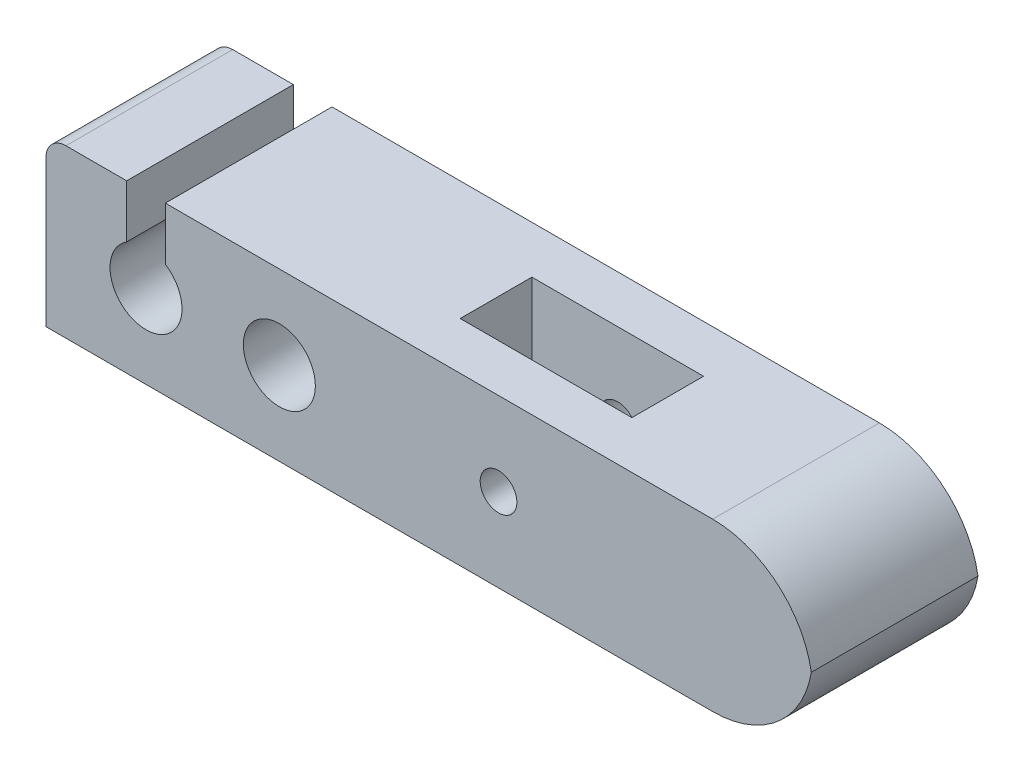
ISO-10303-21;
HEADER;
FILE_DESCRIPTION(('STEP AP214'),'2;1');
FILE_NAME('part.step','',(''),(''),'','','');
FILE_SCHEMA(('AUTOMOTIVE_DESIGN { 1 0 10303 214 1 1 1 1 }'));
ENDSEC;
DATA;
#1=APPLICATION_CONTEXT('core data for automotive mechanical design processes');
#2=APPLICATION_PROTOCOL_DEFINITION('international standard','automotive_design',2000,#1);
#3=PRODUCT_CONTEXT('',#1,'mechanical');
#4=PRODUCT('Part','Part','',(#3));
#5=PRODUCT_RELATED_PRODUCT_CATEGORY('part','',(#4));
#6=PRODUCT_DEFINITION_FORMATION('','',#4);
#7=PRODUCT_DEFINITION_CONTEXT('part definition',#1,'design');
#8=PRODUCT_DEFINITION('design','',#6,#7);
#9=PRODUCT_DEFINITION_SHAPE('','',#8);
#10=(LENGTH_UNIT() NAMED_UNIT(*) SI_UNIT(.MILLI.,.METRE.));
#11=(NAMED_UNIT(*) PLANE_ANGLE_UNIT() SI_UNIT($,.RADIAN.));
#12=(NAMED_UNIT(*) SI_UNIT($,.STERADIAN.) SOLID_ANGLE_UNIT());
#13=UNCERTAINTY_MEASURE_WITH_UNIT(LENGTH_MEASURE(1.E-05),#10,'distance_accuracy_value','');
#14=(GEOMETRIC_REPRESENTATION_CONTEXT(3) GLOBAL_UNCERTAINTY_ASSIGNED_CONTEXT((#13)) GLOBAL_UNIT_ASSIGNED_CONTEXT((#10,
#11,#12)) REPRESENTATION_CONTEXT('',''));
#15=CARTESIAN_POINT('',(0.,0.,0.));
#16=DIRECTION('',(0.,0.,1.));
#17=DIRECTION('',(1.,0.,0.));
#18=AXIS2_PLACEMENT_3D('',#15,#16,#17);
#19=CARTESIAN_POINT('',(-100.,12.5047832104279,25.));
#20=DIRECTION('',(0.,0.,-1.));
#21=DIRECTION('',(-1.,0.,0.));
#22=AXIS2_PLACEMENT_3D('',#19,#20,#21);
#23=CYLINDRICAL_SURFACE('',#22,5.39999999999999);
#24=CARTESIAN_POINT('',(-100.,12.5047832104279,0.));
#25=DIRECTION('',(0.,0.,1.));
#26=DIRECTION('',(1.,0.,0.));
#27=AXIS2_PLACEMENT_3D('',#24,#25,#26);
#28=CIRCLE('',#27,5.39999999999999);
#29=CARTESIAN_POINT('',(-102.9,17.06,0.));
#30=VERTEX_POINT('',#29);
#31=CARTESIAN_POINT('',(-97.1000000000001,17.06,0.));
#32=VERTEX_POINT('',#31);
#33=EDGE_CURVE('E241',#30,#32,#28,.T.);
#34=ORIENTED_EDGE('',*,*,#33,.F.);
#35=DIRECTION('',(0.,0.,-1.));
#36=VECTOR('',#35,1.);
#37=CARTESIAN_POINT('',(-102.9,17.06,25.));
#38=LINE('',#37,#36);
#39=CARTESIAN_POINT('',(-102.9,17.06,25.));
#40=VERTEX_POINT('',#39);
#41=EDGE_CURVE('E276',#40,#30,#38,.T.);
#42=ORIENTED_EDGE('',*,*,#41,.F.);
#43=CARTESIAN_POINT('',(-100.,12.5047832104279,25.));
#44=DIRECTION('',(0.,0.,1.));
#45=DIRECTION('',(1.,0.,0.));
#46=AXIS2_PLACEMENT_3D('',#43,#44,#45);
#47=CIRCLE('',#46,5.39999999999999);
#48=CARTESIAN_POINT('',(-97.1000000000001,17.06,25.));
#49=VERTEX_POINT('',#48);
#50=EDGE_CURVE('E213',#40,#49,#47,.T.);
#51=ORIENTED_EDGE('',*,*,#50,.T.);
#52=DIRECTION('',(0.,0.,-1.));
#53=VECTOR('',#52,1.);
#54=CARTESIAN_POINT('',(-97.1000000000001,17.06,25.));
#55=LINE('',#54,#53);
#56=EDGE_CURVE('E237',#49,#32,#55,.T.);
#57=ORIENTED_EDGE('',*,*,#56,.T.);
#58=EDGE_LOOP('',(#34,#42,#51,#57));
#59=FACE_BOUND('',#58,.T.);
#60=ADVANCED_FACE('F58',(#59),#23,.F.);
#61=CARTESIAN_POINT('',(-102.9,0.,25.));
#62=DIRECTION('',(-1.,0.,0.));
#63=DIRECTION('',(0.,0.,1.));
#64=AXIS2_PLACEMENT_3D('',#61,#62,#63);
#65=PLANE('',#64);
#66=DIRECTION('',(0.,1.,0.));
#67=VECTOR('',#66,1.);
#68=CARTESIAN_POINT('',(-102.9,0.,0.));
#69=LINE('',#68,#67);
#70=CARTESIAN_POINT('',(-102.9,25.,0.));
#71=VERTEX_POINT('',#70);
#72=EDGE_CURVE('E245',#30,#71,#69,.T.);
#73=ORIENTED_EDGE('',*,*,#72,.T.);
#74=DIRECTION('',(0.,0.,-1.));
#75=VECTOR('',#74,1.);
#76=CARTESIAN_POINT('',(-102.9,25.,25.));
#77=LINE('',#76,#75);
#78=CARTESIAN_POINT('',(-102.9,25.,25.));
#79=VERTEX_POINT('',#78);
#80=EDGE_CURVE('E272',#79,#71,#77,.T.);
#81=ORIENTED_EDGE('',*,*,#80,.F.);
#82=DIRECTION('',(0.,1.,0.));
#83=VECTOR('',#82,1.);
#84=CARTESIAN_POINT('',(-102.9,0.,25.));
#85=LINE('',#84,#83);
#86=EDGE_CURVE('E218',#40,#79,#85,.T.);
#87=ORIENTED_EDGE('',*,*,#86,.F.);
#88=ORIENTED_EDGE('',*,*,#41,.T.);
#89=EDGE_LOOP('',(#73,#81,#87,#88));
#90=FACE_BOUND('',#89,.T.);
#91=ADVANCED_FACE('F395',(#90),#65,.F.);
#92=CARTESIAN_POINT('',(0.,25.,25.));
#93=DIRECTION('',(0.,-1.,0.));
#94=DIRECTION('',(1.,0.,0.));
#95=AXIS2_PLACEMENT_3D('',#92,#93,#94);
#96=PLANE('',#95);
#97=DIRECTION('',(-1.,0.,0.));
#98=VECTOR('',#97,1.);
#99=CARTESIAN_POINT('',(0.,25.,0.));
#100=LINE('',#99,#98);
#101=CARTESIAN_POINT('',(-112.,25.,0.));
#102=VERTEX_POINT('',#101);
#103=EDGE_CURVE('E249',#71,#102,#100,.T.);
#104=ORIENTED_EDGE('',*,*,#103,.T.);
#105=DIRECTION('',(0.,0.,-1.));
#106=VECTOR('',#105,1.);
#107=CARTESIAN_POINT('',(-112.,25.,25.));
#108=LINE('',#107,#106);
#109=CARTESIAN_POINT('',(-112.,25.,25.));
#110=VERTEX_POINT('',#109);
#111=EDGE_CURVE('E67',#102,#110,#108,.F.);
#112=ORIENTED_EDGE('',*,*,#111,.T.);
#113=DIRECTION('',(-1.,0.,0.));
#114=VECTOR('',#113,1.);
#115=CARTESIAN_POINT('',(0.,25.,25.));
#116=LINE('',#115,#114);
#117=EDGE_CURVE('E222',#79,#110,#116,.T.);
#118=ORIENTED_EDGE('',*,*,#117,.F.);
#119=ORIENTED_EDGE('',*,*,#80,.T.);
#120=EDGE_LOOP('',(#104,#112,#118,#119));
#121=FACE_BOUND('',#120,.T.);
#122=ADVANCED_FACE('F393',(#121),#96,.F.);
#123=CARTESIAN_POINT('',(-115.,0.,25.));
#124=DIRECTION('',(-1.,0.,0.));
#125=DIRECTION('',(0.,0.,1.));
#126=AXIS2_PLACEMENT_3D('',#123,#124,#125);
#127=PLANE('',#126);
#128=DIRECTION('',(0.,1.,0.));
#129=VECTOR('',#128,1.);
#130=CARTESIAN_POINT('',(-115.,0.,25.));
#131=LINE('',#130,#129);
#132=CARTESIAN_POINT('',(-115.,0.,25.));
#133=VERTEX_POINT('',#132);
#134=CARTESIAN_POINT('',(-115.,22.,25.));
#135=VERTEX_POINT('',#134);
#136=EDGE_CURVE('E225',#133,#135,#131,.T.);
#137=ORIENTED_EDGE('',*,*,#136,.T.);
#138=DIRECTION('',(0.,0.,-1.));
#139=VECTOR('',#138,1.);
#140=CARTESIAN_POINT('',(-115.,22.,0.));
#141=LINE('',#140,#139);
#142=CARTESIAN_POINT('',(-115.,22.,0.));
#143=VERTEX_POINT('',#142);
#144=EDGE_CURVE('E304',#135,#143,#141,.T.);
#145=ORIENTED_EDGE('',*,*,#144,.T.);
#146=DIRECTION('',(0.,1.,0.));
#147=VECTOR('',#146,1.);
#148=CARTESIAN_POINT('',(-115.,0.,0.));
#149=LINE('',#148,#147);
#150=CARTESIAN_POINT('',(-115.,0.,0.));
#151=VERTEX_POINT('',#150);
#152=EDGE_CURVE('E252',#151,#143,#149,.T.);
#153=ORIENTED_EDGE('',*,*,#152,.F.);
#154=DIRECTION('',(0.,0.,-1.));
#155=VECTOR('',#154,1.);
#156=CARTESIAN_POINT('',(-115.,0.,25.));
#157=LINE('',#156,#155);
#158=EDGE_CURVE('E268',#133,#151,#157,.T.);
#159=ORIENTED_EDGE('',*,*,#158,.F.);
#160=EDGE_LOOP('',(#137,#145,#153,#159));
#161=FACE_BOUND('',#160,.T.);
#162=ADVANCED_FACE('F388',(#161),#127,.T.);
#163=CARTESIAN_POINT('',(0.,0.,25.));
#164=DIRECTION('',(0.,-1.,0.));
#165=DIRECTION('',(1.,0.,0.));
#166=AXIS2_PLACEMENT_3D('',#163,#164,#165);
#167=PLANE('',#166);
#168=DIRECTION('',(1.,0.,0.));
#169=VECTOR('',#168,1.);
#170=CARTESIAN_POINT('',(-60.,0.,17.875));
#171=LINE('',#170,#169);
#172=CARTESIAN_POINT('',(-60.,0.,17.875));
#173=VERTEX_POINT('',#172);
#174=CARTESIAN_POINT('',(-34.25,0.,17.875));
#175=VERTEX_POINT('',#174);
#176=EDGE_CURVE('E173',#173,#175,#171,.T.);
#177=ORIENTED_EDGE('',*,*,#176,.T.);
#178=DIRECTION('',(0.,0.,-1.));
#179=VECTOR('',#178,1.);
#180=CARTESIAN_POINT('',(-34.25,0.,7.12500000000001));
#181=LINE('',#180,#179);
#182=CARTESIAN_POINT('',(-34.25,0.,7.12500000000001));
#183=VERTEX_POINT('',#182);
#184=EDGE_CURVE('E158',#175,#183,#181,.T.);
#185=ORIENTED_EDGE('',*,*,#184,.T.);
#186=DIRECTION('',(-1.,0.,0.));
#187=VECTOR('',#186,1.);
#188=CARTESIAN_POINT('',(-60.,0.,7.12500000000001));
#189=LINE('',#188,#187);
#190=CARTESIAN_POINT('',(-60.,0.,7.12500000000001));
#191=VERTEX_POINT('',#190);
#192=EDGE_CURVE('E198',#183,#191,#189,.T.);
#193=ORIENTED_EDGE('',*,*,#192,.T.);
#194=DIRECTION('',(0.,0.,1.));
#195=VECTOR('',#194,1.);
#196=CARTESIAN_POINT('',(-60.,0.,7.12500000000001));
#197=LINE('',#196,#195);
#198=EDGE_CURVE('E182',#191,#173,#197,.T.);
#199=ORIENTED_EDGE('',*,*,#198,.T.);
#200=EDGE_LOOP('',(#177,#185,#193,#199));
#201=FACE_BOUND('',#200,.T.);
#202=DIRECTION('',(-1.,0.,0.));
#203=VECTOR('',#202,1.);
#204=CARTESIAN_POINT('',(0.,0.,0.));
#205=LINE('',#204,#203);
#206=CARTESIAN_POINT('',(-15.,0.,0.));
#207=VERTEX_POINT('',#206);
#208=EDGE_CURVE('E256',#207,#151,#205,.T.);
#209=ORIENTED_EDGE('',*,*,#208,.F.);
#210=DIRECTION('',(0.,0.,-1.));
#211=VECTOR('',#210,1.);
#212=CARTESIAN_POINT('',(-15.,0.,25.));
#213=LINE('',#212,#211);
#214=CARTESIAN_POINT('',(-15.,0.,25.));
#215=VERTEX_POINT('',#214);
#216=EDGE_CURVE('E291',#207,#215,#213,.F.);
#217=ORIENTED_EDGE('',*,*,#216,.T.);
#218=DIRECTION('',(-1.,0.,0.));
#219=VECTOR('',#218,1.);
#220=CARTESIAN_POINT('',(0.,0.,25.));
#221=LINE('',#220,#219);
#222=EDGE_CURVE('E230',#215,#133,#221,.T.);
#223=ORIENTED_EDGE('',*,*,#222,.T.);
#224=ORIENTED_EDGE('',*,*,#158,.T.);
#225=EDGE_LOOP('',(#209,#217,#223,#224));
#226=FACE_BOUND('',#225,.T.);
#227=ADVANCED_FACE('F180',(#201,#226),#167,.T.);
#228=DIRECTION('',(0.,0.,-1.));
#229=VECTOR('',#228,1.);
#230=CARTESIAN_POINT('',(-34.25,25.,7.12500000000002));
#231=LINE('',#230,#229);
#232=CARTESIAN_POINT('',(-34.25,25.,17.875));
#233=VERTEX_POINT('',#232);
#234=CARTESIAN_POINT('',(-34.25,25.,7.12500000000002));
#235=VERTEX_POINT('',#234);
#236=EDGE_CURVE('E188',#233,#235,#231,.T.);
#237=ORIENTED_EDGE('',*,*,#236,.F.);
#238=DIRECTION('',(1.,0.,0.));
#239=VECTOR('',#238,1.);
#240=CARTESIAN_POINT('',(-60.,25.,17.875));
#241=LINE('',#240,#239);
#242=CARTESIAN_POINT('',(-60.,25.,17.875));
#243=VERTEX_POINT('',#242);
#244=EDGE_CURVE('E176',#243,#233,#241,.T.);
#245=ORIENTED_EDGE('',*,*,#244,.F.);
#246=DIRECTION('',(0.,0.,1.));
#247=VECTOR('',#246,1.);
#248=CARTESIAN_POINT('',(-60.,25.,7.12500000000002));
#249=LINE('',#248,#247);
#250=CARTESIAN_POINT('',(-60.,25.,7.12500000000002));
#251=VERTEX_POINT('',#250);
#252=EDGE_CURVE('E192',#251,#243,#249,.T.);
#253=ORIENTED_EDGE('',*,*,#252,.F.);
#254=DIRECTION('',(-1.,0.,0.));
#255=VECTOR('',#254,1.);
#256=CARTESIAN_POINT('',(-60.,25.,7.12500000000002));
#257=LINE('',#256,#255);
#258=EDGE_CURVE('E184',#235,#251,#257,.T.);
#259=ORIENTED_EDGE('',*,*,#258,.F.);
#260=EDGE_LOOP('',(#237,#245,#253,#259));
#261=FACE_BOUND('',#260,.T.);
#262=CARTESIAN_POINT('',(-15.,25.,25.));
#263=VERTEX_POINT('',#262);
#264=CARTESIAN_POINT('',(-97.1,25.,25.));
#265=VERTEX_POINT('',#264);
#266=EDGE_CURVE('E226',#263,#265,#116,.T.);
#267=ORIENTED_EDGE('',*,*,#266,.F.);
#268=DIRECTION('',(0.,0.,-1.));
#269=VECTOR('',#268,1.);
#270=CARTESIAN_POINT('',(-15.,25.,25.));
#271=LINE('',#270,#269);
#272=CARTESIAN_POINT('',(-15.,25.,0.));
#273=VERTEX_POINT('',#272);
#274=EDGE_CURVE('E301',#263,#273,#271,.T.);
#275=ORIENTED_EDGE('',*,*,#274,.T.);
#276=CARTESIAN_POINT('',(-97.1000000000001,25.,0.));
#277=VERTEX_POINT('',#276);
#278=EDGE_CURVE('E253',#273,#277,#100,.T.);
#279=ORIENTED_EDGE('',*,*,#278,.T.);
#280=DIRECTION('',(0.,0.,-1.));
#281=VECTOR('',#280,1.);
#282=CARTESIAN_POINT('',(-97.1,25.,25.));
#283=LINE('',#282,#281);
#284=EDGE_CURVE('E264',#265,#277,#283,.T.);
#285=ORIENTED_EDGE('',*,*,#284,.F.);
#286=EDGE_LOOP('',(#267,#275,#279,#285));
#287=FACE_BOUND('',#286,.T.);
#288=ADVANCED_FACE('F359',(#261,#287),#96,.F.);
#289=CARTESIAN_POINT('',(-80.,12.5,25.));
#290=DIRECTION('',(0.,0.,-1.));
#291=DIRECTION('',(-1.,0.,0.));
#292=AXIS2_PLACEMENT_3D('',#289,#290,#291);
#293=CYLINDRICAL_SURFACE('',#292,5.39999999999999);
#294=CARTESIAN_POINT('',(-80.,12.5,25.));
#295=DIRECTION('',(0.,0.,1.));
#296=DIRECTION('',(1.,0.,0.));
#297=AXIS2_PLACEMENT_3D('',#294,#295,#296);
#298=CIRCLE('',#297,5.39999999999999);
#299=CARTESIAN_POINT('',(-74.6,12.5,25.));
#300=VERTEX_POINT('',#299);
#301=EDGE_CURVE('E209',#300,#300,#298,.T.);
#302=ORIENTED_EDGE('',*,*,#301,.T.);
#303=EDGE_LOOP('',(#302));
#304=FACE_BOUND('',#303,.T.);
#305=CARTESIAN_POINT('',(-80.,12.5,0.));
#306=DIRECTION('',(0.,0.,1.));
#307=DIRECTION('',(1.,0.,0.));
#308=AXIS2_PLACEMENT_3D('',#305,#306,#307);
#309=CIRCLE('',#308,5.39999999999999);
#310=CARTESIAN_POINT('',(-74.6,12.5,0.));
#311=VERTEX_POINT('',#310);
#312=EDGE_CURVE('E208',#311,#311,#309,.T.);
#313=ORIENTED_EDGE('',*,*,#312,.F.);
#314=EDGE_LOOP('',(#313));
#315=FACE_BOUND('',#314,.T.);
#316=ADVANCED_FACE('F407',(#304,#315),#293,.F.);
#317=CARTESIAN_POINT('',(-97.1000000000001,0.,25.));
#318=DIRECTION('',(-1.,0.,0.));
#319=DIRECTION('',(0.,0.,1.));
#320=AXIS2_PLACEMENT_3D('',#317,#318,#319);
#321=PLANE('',#320);
#322=DIRECTION('',(0.,1.,0.));
#323=VECTOR('',#322,1.);
#324=CARTESIAN_POINT('',(-97.1000000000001,0.,0.));
#325=LINE('',#324,#323);
#326=EDGE_CURVE('E214',#32,#277,#325,.T.);
#327=ORIENTED_EDGE('',*,*,#326,.F.);
#328=ORIENTED_EDGE('',*,*,#56,.F.);
#329=DIRECTION('',(0.,1.,0.));
#330=VECTOR('',#329,1.);
#331=CARTESIAN_POINT('',(-97.1000000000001,0.,25.));
#332=LINE('',#331,#330);
#333=EDGE_CURVE('E233',#49,#265,#332,.T.);
#334=ORIENTED_EDGE('',*,*,#333,.T.);
#335=ORIENTED_EDGE('',*,*,#284,.T.);
#336=EDGE_LOOP('',(#327,#328,#334,#335));
#337=FACE_BOUND('',#336,.T.);
#338=ADVANCED_FACE('F364',(#337),#321,.T.);
#339=CARTESIAN_POINT('',(0.,0.,25.));
#340=DIRECTION('',(0.,0.,1.));
#341=DIRECTION('',(1.,0.,0.));
#342=AXIS2_PLACEMENT_3D('',#339,#340,#341);
#343=PLANE('',#342);
#344=CARTESIAN_POINT('',(-47.125,12.5,25.));
#345=DIRECTION('',(0.,0.,1.));
#346=DIRECTION('',(1.,0.,0.));
#347=AXIS2_PLACEMENT_3D('',#344,#345,#346);
#348=CIRCLE('',#347,2.75000000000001);
#349=CARTESIAN_POINT('',(-44.375,12.5,25.));
#350=VERTEX_POINT('',#349);
#351=EDGE_CURVE('E309',#350,#350,#348,.T.);
#352=ORIENTED_EDGE('',*,*,#351,.F.);
#353=EDGE_LOOP('',(#352));
#354=FACE_BOUND('',#353,.T.);
#355=ORIENTED_EDGE('',*,*,#301,.F.);
#356=EDGE_LOOP('',(#355));
#357=FACE_BOUND('',#356,.T.);
#358=ORIENTED_EDGE('',*,*,#117,.T.);
#359=CARTESIAN_POINT('',(-112.,22.,25.));
#360=DIRECTION('',(0.,0.,1.));
#361=DIRECTION('',(1.,0.,0.));
#362=AXIS2_PLACEMENT_3D('',#359,#360,#361);
#363=CIRCLE('',#362,3.);
#364=EDGE_CURVE('E13',#110,#135,#363,.T.);
#365=ORIENTED_EDGE('',*,*,#364,.T.);
#366=ORIENTED_EDGE('',*,*,#136,.F.);
#367=ORIENTED_EDGE('',*,*,#222,.F.);
#368=CARTESIAN_POINT('',(-15.,15.,25.));
#369=DIRECTION('',(0.,0.,1.));
#370=DIRECTION('',(1.,0.,0.));
#371=AXIS2_PLACEMENT_3D('',#368,#369,#370);
#372=CIRCLE('',#371,15.);
#373=CARTESIAN_POINT('',(-0.20980054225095,12.5,25.));
#374=VERTEX_POINT('',#373);
#375=EDGE_CURVE('E298',#215,#374,#372,.T.);
#376=ORIENTED_EDGE('',*,*,#375,.T.);
#377=CARTESIAN_POINT('',(-15.,10.,25.));
#378=DIRECTION('',(0.,0.,1.));
#379=DIRECTION('',(1.,0.,0.));
#380=AXIS2_PLACEMENT_3D('',#377,#378,#379);
#381=CIRCLE('',#380,15.);
#382=EDGE_CURVE('E295',#374,#263,#381,.T.);
#383=ORIENTED_EDGE('',*,*,#382,.T.);
#384=ORIENTED_EDGE('',*,*,#266,.T.);
#385=ORIENTED_EDGE('',*,*,#333,.F.);
#386=ORIENTED_EDGE('',*,*,#50,.F.);
#387=ORIENTED_EDGE('',*,*,#86,.T.);
#388=EDGE_LOOP('',(#358,#365,#366,#367,#376,#383,#384,#385,#386,#387));
#389=FACE_BOUND('',#388,.T.);
#390=ADVANCED_FACE('F373',(#354,#357,#389),#343,.T.);
#391=CARTESIAN_POINT('',(0.,0.,0.));
#392=DIRECTION('',(0.,0.,1.));
#393=DIRECTION('',(1.,0.,0.));
#394=AXIS2_PLACEMENT_3D('',#391,#392,#393);
#395=PLANE('',#394);
#396=CARTESIAN_POINT('',(-47.125,12.5,0.));
#397=DIRECTION('',(0.,0.,1.));
#398=DIRECTION('',(1.,0.,0.));
#399=AXIS2_PLACEMENT_3D('',#396,#397,#398);
#400=CIRCLE('',#399,2.75000000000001);
#401=CARTESIAN_POINT('',(-44.375,12.5,0.));
#402=VERTEX_POINT('',#401);
#403=EDGE_CURVE('E285',#402,#402,#400,.T.);
#404=ORIENTED_EDGE('',*,*,#403,.T.);
#405=EDGE_LOOP('',(#404));
#406=FACE_BOUND('',#405,.T.);
#407=ORIENTED_EDGE('',*,*,#312,.T.);
#408=EDGE_LOOP('',(#407));
#409=FACE_BOUND('',#408,.T.);
#410=ORIENTED_EDGE('',*,*,#152,.T.);
#411=CARTESIAN_POINT('',(-112.,22.,0.));
#412=DIRECTION('',(0.,0.,1.));
#413=DIRECTION('',(1.,0.,0.));
#414=AXIS2_PLACEMENT_3D('',#411,#412,#413);
#415=CIRCLE('',#414,3.);
#416=EDGE_CURVE('E81',#143,#102,#415,.F.);
#417=ORIENTED_EDGE('',*,*,#416,.T.);
#418=ORIENTED_EDGE('',*,*,#103,.F.);
#419=ORIENTED_EDGE('',*,*,#72,.F.);
#420=ORIENTED_EDGE('',*,*,#33,.T.);
#421=ORIENTED_EDGE('',*,*,#326,.T.);
#422=ORIENTED_EDGE('',*,*,#278,.F.);
#423=CARTESIAN_POINT('',(-15.,10.,0.));
#424=DIRECTION('',(0.,0.,1.));
#425=DIRECTION('',(1.,0.,0.));
#426=AXIS2_PLACEMENT_3D('',#423,#424,#425);
#427=CIRCLE('',#426,15.);
#428=CARTESIAN_POINT('',(-0.20980054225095,12.5,0.));
#429=VERTEX_POINT('',#428);
#430=EDGE_CURVE('E279',#273,#429,#427,.F.);
#431=ORIENTED_EDGE('',*,*,#430,.T.);
#432=CARTESIAN_POINT('',(-15.,15.,0.));
#433=DIRECTION('',(0.,0.,1.));
#434=DIRECTION('',(1.,0.,0.));
#435=AXIS2_PLACEMENT_3D('',#432,#433,#434);
#436=CIRCLE('',#435,15.);
#437=EDGE_CURVE('E288',#429,#207,#436,.F.);
#438=ORIENTED_EDGE('',*,*,#437,.T.);
#439=ORIENTED_EDGE('',*,*,#208,.T.);
#440=EDGE_LOOP('',(#410,#417,#418,#419,#420,#421,#422,#431,#438,#439));
#441=FACE_BOUND('',#440,.T.);
#442=ADVANCED_FACE('F366',(#406,#409,#441),#395,.F.);
#443=CARTESIAN_POINT('',(-60.,-27.9038527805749,17.875));
#444=DIRECTION('',(0.,0.,1.));
#445=DIRECTION('',(1.,0.,0.));
#446=AXIS2_PLACEMENT_3D('',#443,#444,#445);
#447=PLANE('',#446);
#448=CARTESIAN_POINT('',(-47.125,12.5,17.875));
#449=DIRECTION('',(0.,0.,1.));
#450=DIRECTION('',(1.,0.,0.));
#451=AXIS2_PLACEMENT_3D('',#448,#449,#450);
#452=CIRCLE('',#451,2.75000000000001);
#453=CARTESIAN_POINT('',(-44.375,12.5,17.875));
#454=VERTEX_POINT('',#453);
#455=EDGE_CURVE('E284',#454,#454,#452,.T.);
#456=ORIENTED_EDGE('',*,*,#455,.T.);
#457=EDGE_LOOP('',(#456));
#458=FACE_BOUND('',#457,.T.);
#459=DIRECTION('',(0.,1.,0.));
#460=VECTOR('',#459,1.);
#461=CARTESIAN_POINT('',(-60.,-27.9038527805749,17.875));
#462=LINE('',#461,#460);
#463=EDGE_CURVE('E196',#173,#243,#462,.T.);
#464=ORIENTED_EDGE('',*,*,#463,.T.);
#465=ORIENTED_EDGE('',*,*,#244,.T.);
#466=DIRECTION('',(0.,1.,0.));
#467=VECTOR('',#466,1.);
#468=CARTESIAN_POINT('',(-34.25,-27.9038527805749,17.875));
#469=LINE('',#468,#467);
#470=EDGE_CURVE('E162',#175,#233,#469,.T.);
#471=ORIENTED_EDGE('',*,*,#470,.F.);
#472=ORIENTED_EDGE('',*,*,#176,.F.);
#473=EDGE_LOOP('',(#464,#465,#471,#472));
#474=FACE_BOUND('',#473,.T.);
#475=ADVANCED_FACE('F172',(#458,#474),#447,.F.);
#476=CARTESIAN_POINT('',(-34.25,-27.903852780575,7.12500000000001));
#477=DIRECTION('',(1.,0.,0.));
#478=DIRECTION('',(0.,0.,-1.));
#479=AXIS2_PLACEMENT_3D('',#476,#477,#478);
#480=PLANE('',#479);
#481=ORIENTED_EDGE('',*,*,#470,.T.);
#482=ORIENTED_EDGE('',*,*,#236,.T.);
#483=DIRECTION('',(0.,1.,0.));
#484=VECTOR('',#483,1.);
#485=CARTESIAN_POINT('',(-34.25,-27.903852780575,7.12500000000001));
#486=LINE('',#485,#484);
#487=EDGE_CURVE('E164',#183,#235,#486,.T.);
#488=ORIENTED_EDGE('',*,*,#487,.F.);
#489=ORIENTED_EDGE('',*,*,#184,.F.);
#490=EDGE_LOOP('',(#481,#482,#488,#489));
#491=FACE_BOUND('',#490,.T.);
#492=ADVANCED_FACE('F160',(#491),#480,.F.);
#493=CARTESIAN_POINT('',(-60.,-27.9038527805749,7.12500000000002));
#494=DIRECTION('',(0.,0.,-1.));
#495=DIRECTION('',(-1.,0.,0.));
#496=AXIS2_PLACEMENT_3D('',#493,#494,#495);
#497=PLANE('',#496);
#498=CARTESIAN_POINT('',(-47.125,12.5,7.12500000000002));
#499=DIRECTION('',(0.,0.,-1.));
#500=DIRECTION('',(-1.,0.,0.));
#501=AXIS2_PLACEMENT_3D('',#498,#499,#500);
#502=CIRCLE('',#501,2.75000000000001);
#503=CARTESIAN_POINT('',(-49.875,12.5,7.12500000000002));
#504=VERTEX_POINT('',#503);
#505=EDGE_CURVE('E280',#504,#504,#502,.T.);
#506=ORIENTED_EDGE('',*,*,#505,.T.);
#507=EDGE_LOOP('',(#506));
#508=FACE_BOUND('',#507,.T.);
#509=ORIENTED_EDGE('',*,*,#487,.T.);
#510=ORIENTED_EDGE('',*,*,#258,.T.);
#511=DIRECTION('',(0.,1.,0.));
#512=VECTOR('',#511,1.);
#513=CARTESIAN_POINT('',(-60.,-27.9038527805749,7.12500000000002));
#514=LINE('',#513,#512);
#515=EDGE_CURVE('E197',#191,#251,#514,.T.);
#516=ORIENTED_EDGE('',*,*,#515,.F.);
#517=ORIENTED_EDGE('',*,*,#192,.F.);
#518=EDGE_LOOP('',(#509,#510,#516,#517));
#519=FACE_BOUND('',#518,.T.);
#520=ADVANCED_FACE('F430',(#508,#519),#497,.F.);
#521=CARTESIAN_POINT('',(-60.,-27.9038527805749,7.12500000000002));
#522=DIRECTION('',(-1.,0.,0.));
#523=DIRECTION('',(0.,0.,1.));
#524=AXIS2_PLACEMENT_3D('',#521,#522,#523);
#525=PLANE('',#524);
#526=ORIENTED_EDGE('',*,*,#515,.T.);
#527=ORIENTED_EDGE('',*,*,#252,.T.);
#528=ORIENTED_EDGE('',*,*,#463,.F.);
#529=ORIENTED_EDGE('',*,*,#198,.F.);
#530=EDGE_LOOP('',(#526,#527,#528,#529));
#531=FACE_BOUND('',#530,.T.);
#532=ADVANCED_FACE('F423',(#531),#525,.F.);
#533=CARTESIAN_POINT('',(-47.125,12.5,0.));
#534=DIRECTION('',(0.,0.,1.));
#535=DIRECTION('',(1.,0.,0.));
#536=AXIS2_PLACEMENT_3D('',#533,#534,#535);
#537=CYLINDRICAL_SURFACE('',#536,2.75000000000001);
#538=ORIENTED_EDGE('',*,*,#403,.F.);
#539=EDGE_LOOP('',(#538));
#540=FACE_BOUND('',#539,.T.);
#541=ORIENTED_EDGE('',*,*,#505,.F.);
#542=EDGE_LOOP('',(#541));
#543=FACE_BOUND('',#542,.T.);
#544=ADVANCED_FACE('F417',(#540,#543),#537,.F.);
#545=ORIENTED_EDGE('',*,*,#351,.T.);
#546=EDGE_LOOP('',(#545));
#547=FACE_BOUND('',#546,.T.);
#548=ORIENTED_EDGE('',*,*,#455,.F.);
#549=EDGE_LOOP('',(#548));
#550=FACE_BOUND('',#549,.T.);
#551=ADVANCED_FACE('F413',(#547,#550),#537,.F.);
#552=CARTESIAN_POINT('',(-15.,10.,25.));
#553=DIRECTION('',(0.,0.,-1.));
#554=DIRECTION('',(-1.,0.,0.));
#555=AXIS2_PLACEMENT_3D('',#552,#553,#554);
#556=CYLINDRICAL_SURFACE('',#555,15.);
#557=ORIENTED_EDGE('',*,*,#274,.F.);
#558=ORIENTED_EDGE('',*,*,#382,.F.);
#559=DIRECTION('',(0.,0.,-1.));
#560=VECTOR('',#559,1.);
#561=CARTESIAN_POINT('',(-0.209800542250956,12.5,12.5));
#562=LINE('',#561,#560);
#563=EDGE_CURVE('E305',#429,#374,#562,.F.);
#564=ORIENTED_EDGE('',*,*,#563,.F.);
#565=ORIENTED_EDGE('',*,*,#430,.F.);
#566=EDGE_LOOP('',(#557,#558,#564,#565));
#567=FACE_BOUND('',#566,.T.);
#568=ADVANCED_FACE('F376',(#567),#556,.T.);
#569=CARTESIAN_POINT('',(-15.,15.,25.));
#570=DIRECTION('',(0.,0.,1.));
#571=DIRECTION('',(1.,0.,0.));
#572=AXIS2_PLACEMENT_3D('',#569,#570,#571);
#573=CYLINDRICAL_SURFACE('',#572,15.);
#574=ORIENTED_EDGE('',*,*,#375,.F.);
#575=ORIENTED_EDGE('',*,*,#216,.F.);
#576=ORIENTED_EDGE('',*,*,#437,.F.);
#577=ORIENTED_EDGE('',*,*,#563,.T.);
#578=EDGE_LOOP('',(#574,#575,#576,#577));
#579=FACE_BOUND('',#578,.T.);
#580=ADVANCED_FACE('F385',(#579),#573,.T.);
#581=CARTESIAN_POINT('',(-112.,22.,25.));
#582=DIRECTION('',(0.,0.,1.));
#583=DIRECTION('',(1.,0.,0.));
#584=AXIS2_PLACEMENT_3D('',#581,#582,#583);
#585=CYLINDRICAL_SURFACE('',#584,3.);
#586=ORIENTED_EDGE('',*,*,#364,.F.);
#587=ORIENTED_EDGE('',*,*,#111,.F.);
#588=ORIENTED_EDGE('',*,*,#416,.F.);
#589=ORIENTED_EDGE('',*,*,#144,.F.);
#590=EDGE_LOOP('',(#586,#587,#588,#589));
#591=FACE_BOUND('',#590,.T.);
#592=ADVANCED_FACE('F60',(#591),#585,.T.);
#593=CLOSED_SHELL('',(#60,#91,#122,#162,#227,#288,#316,#338,#390,#442,#475,#492,#520,#532,#544,
#551,#568,#580,#592));
#594=MANIFOLD_SOLID_BREP('B2',#593);
#595=ADVANCED_BREP_SHAPE_REPRESENTATION('',(#18,#594),#14);
#596=SHAPE_DEFINITION_REPRESENTATION(#9,#595);
ENDSEC;
END-ISO-10303-21;
